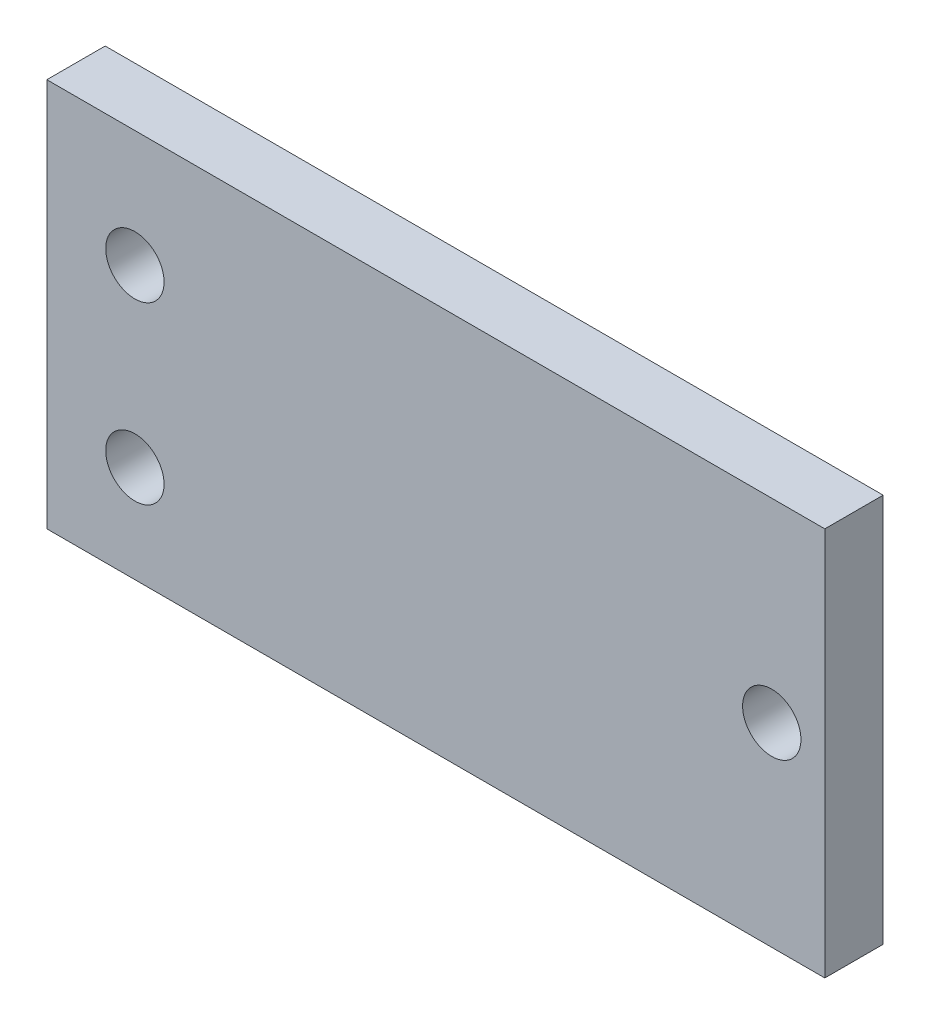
ISO-10303-21;
HEADER;
FILE_DESCRIPTION(('STEP AP214'),'2;1');
FILE_NAME('part.step','',(''),(''),'','','');
FILE_SCHEMA(('AUTOMOTIVE_DESIGN { 1 0 10303 214 1 1 1 1 }'));
ENDSEC;
DATA;
#1=APPLICATION_CONTEXT('core data for automotive mechanical design processes');
#2=APPLICATION_PROTOCOL_DEFINITION('international standard','automotive_design',2000,#1);
#3=PRODUCT_CONTEXT('',#1,'mechanical');
#4=PRODUCT('Part','Part','',(#3));
#5=PRODUCT_RELATED_PRODUCT_CATEGORY('part','',(#4));
#6=PRODUCT_DEFINITION_FORMATION('','',#4);
#7=PRODUCT_DEFINITION_CONTEXT('part definition',#1,'design');
#8=PRODUCT_DEFINITION('design','',#6,#7);
#9=PRODUCT_DEFINITION_SHAPE('','',#8);
#10=(LENGTH_UNIT() NAMED_UNIT(*) SI_UNIT(.MILLI.,.METRE.));
#11=(NAMED_UNIT(*) PLANE_ANGLE_UNIT() SI_UNIT($,.RADIAN.));
#12=(NAMED_UNIT(*) SI_UNIT($,.STERADIAN.) SOLID_ANGLE_UNIT());
#13=UNCERTAINTY_MEASURE_WITH_UNIT(LENGTH_MEASURE(1.E-05),#10,'distance_accuracy_value','');
#14=(GEOMETRIC_REPRESENTATION_CONTEXT(3) GLOBAL_UNCERTAINTY_ASSIGNED_CONTEXT((#13)) GLOBAL_UNIT_ASSIGNED_CONTEXT((#10,
#11,#12)) REPRESENTATION_CONTEXT('',''));
#15=CARTESIAN_POINT('',(0.,0.,0.));
#16=DIRECTION('',(0.,0.,1.));
#17=DIRECTION('',(1.,0.,0.));
#18=AXIS2_PLACEMENT_3D('',#15,#16,#17);
#19=CARTESIAN_POINT('',(0.,0.,3.));
#20=DIRECTION('',(0.,0.,1.));
#21=DIRECTION('',(1.,0.,0.));
#22=AXIS2_PLACEMENT_3D('',#19,#20,#21);
#23=PLANE('',#22);
#24=CARTESIAN_POINT('',(4.52685421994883,-6.,3.));
#25=DIRECTION('',(0.,0.,1.));
#26=DIRECTION('',(1.,0.,0.));
#27=AXIS2_PLACEMENT_3D('',#24,#25,#26);
#28=CIRCLE('',#27,1.5);
#29=CARTESIAN_POINT('',(6.02685421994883,-6.,3.));
#30=VERTEX_POINT('',#29);
#31=EDGE_CURVE('E134',#30,#30,#28,.T.);
#32=ORIENTED_EDGE('',*,*,#31,.F.);
#33=EDGE_LOOP('',(#32));
#34=FACE_BOUND('',#33,.T.);
#35=DIRECTION('',(0.,-1.,0.));
#36=VECTOR('',#35,1.);
#37=CARTESIAN_POINT('',(0.,0.,3.));
#38=LINE('',#37,#36);
#39=CARTESIAN_POINT('',(0.,0.,3.));
#40=VERTEX_POINT('',#39);
#41=CARTESIAN_POINT('',(0.,-20.,3.));
#42=VERTEX_POINT('',#41);
#43=EDGE_CURVE('E92',#40,#42,#38,.T.);
#44=ORIENTED_EDGE('',*,*,#43,.T.);
#45=DIRECTION('',(1.,0.,0.));
#46=VECTOR('',#45,1.);
#47=CARTESIAN_POINT('',(0.,-20.,3.));
#48=LINE('',#47,#46);
#49=CARTESIAN_POINT('',(40.,-20.,3.));
#50=VERTEX_POINT('',#49);
#51=EDGE_CURVE('E87',#42,#50,#48,.T.);
#52=ORIENTED_EDGE('',*,*,#51,.T.);
#53=DIRECTION('',(0.,1.,0.));
#54=VECTOR('',#53,1.);
#55=CARTESIAN_POINT('',(40.,0.,3.));
#56=LINE('',#55,#54);
#57=CARTESIAN_POINT('',(40.,0.,3.));
#58=VERTEX_POINT('',#57);
#59=EDGE_CURVE('E90',#50,#58,#56,.T.);
#60=ORIENTED_EDGE('',*,*,#59,.T.);
#61=DIRECTION('',(-1.,0.,0.));
#62=VECTOR('',#61,1.);
#63=CARTESIAN_POINT('',(0.,0.,3.));
#64=LINE('',#63,#62);
#65=EDGE_CURVE('E57',#58,#40,#64,.T.);
#66=ORIENTED_EDGE('',*,*,#65,.T.);
#67=EDGE_LOOP('',(#44,#52,#60,#66));
#68=FACE_BOUND('',#67,.T.);
#69=CARTESIAN_POINT('',(37.2725058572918,-10.,3.));
#70=DIRECTION('',(0.,0.,1.));
#71=DIRECTION('',(1.,0.,0.));
#72=AXIS2_PLACEMENT_3D('',#69,#70,#71);
#73=CIRCLE('',#72,1.5);
#74=CARTESIAN_POINT('',(38.7725058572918,-10.,3.));
#75=VERTEX_POINT('',#74);
#76=EDGE_CURVE('E112',#75,#75,#73,.T.);
#77=ORIENTED_EDGE('',*,*,#76,.F.);
#78=EDGE_LOOP('',(#77));
#79=FACE_BOUND('',#78,.T.);
#80=CARTESIAN_POINT('',(4.52685421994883,-15.,3.));
#81=DIRECTION('',(0.,0.,1.));
#82=DIRECTION('',(1.,0.,0.));
#83=AXIS2_PLACEMENT_3D('',#80,#81,#82);
#84=CIRCLE('',#83,1.5);
#85=CARTESIAN_POINT('',(6.02685421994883,-15.,3.));
#86=VERTEX_POINT('',#85);
#87=EDGE_CURVE('E142',#86,#86,#84,.T.);
#88=ORIENTED_EDGE('',*,*,#87,.F.);
#89=EDGE_LOOP('',(#88));
#90=FACE_BOUND('',#89,.T.);
#91=ADVANCED_FACE('F39',(#34,#68,#79,#90),#23,.T.);
#92=CARTESIAN_POINT('',(0.,0.,0.));
#93=DIRECTION('',(0.,0.,1.));
#94=DIRECTION('',(1.,0.,0.));
#95=AXIS2_PLACEMENT_3D('',#92,#93,#94);
#96=PLANE('',#95);
#97=DIRECTION('',(0.,-1.,0.));
#98=VECTOR('',#97,1.);
#99=CARTESIAN_POINT('',(0.,0.,0.));
#100=LINE('',#99,#98);
#101=CARTESIAN_POINT('',(0.,0.,0.));
#102=VERTEX_POINT('',#101);
#103=CARTESIAN_POINT('',(0.,-20.,0.));
#104=VERTEX_POINT('',#103);
#105=EDGE_CURVE('E108',#102,#104,#100,.T.);
#106=ORIENTED_EDGE('',*,*,#105,.F.);
#107=DIRECTION('',(-1.,0.,0.));
#108=VECTOR('',#107,1.);
#109=CARTESIAN_POINT('',(0.,0.,0.));
#110=LINE('',#109,#108);
#111=CARTESIAN_POINT('',(40.,0.,0.));
#112=VERTEX_POINT('',#111);
#113=EDGE_CURVE('E80',#112,#102,#110,.T.);
#114=ORIENTED_EDGE('',*,*,#113,.F.);
#115=DIRECTION('',(0.,1.,0.));
#116=VECTOR('',#115,1.);
#117=CARTESIAN_POINT('',(40.,0.,0.));
#118=LINE('',#117,#116);
#119=CARTESIAN_POINT('',(40.,-20.,0.));
#120=VERTEX_POINT('',#119);
#121=EDGE_CURVE('E74',#120,#112,#118,.T.);
#122=ORIENTED_EDGE('',*,*,#121,.F.);
#123=DIRECTION('',(1.,0.,0.));
#124=VECTOR('',#123,1.);
#125=CARTESIAN_POINT('',(0.,-20.,0.));
#126=LINE('',#125,#124);
#127=EDGE_CURVE('E97',#104,#120,#126,.T.);
#128=ORIENTED_EDGE('',*,*,#127,.F.);
#129=EDGE_LOOP('',(#106,#114,#122,#128));
#130=FACE_BOUND('',#129,.T.);
#131=CARTESIAN_POINT('',(37.2725058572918,-10.,0.));
#132=DIRECTION('',(0.,0.,1.));
#133=DIRECTION('',(1.,0.,0.));
#134=AXIS2_PLACEMENT_3D('',#131,#132,#133);
#135=CIRCLE('',#134,1.5);
#136=CARTESIAN_POINT('',(38.7725058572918,-10.,0.));
#137=VERTEX_POINT('',#136);
#138=EDGE_CURVE('E130',#137,#137,#135,.T.);
#139=ORIENTED_EDGE('',*,*,#138,.T.);
#140=EDGE_LOOP('',(#139));
#141=FACE_BOUND('',#140,.T.);
#142=CARTESIAN_POINT('',(4.52685421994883,-6.,0.));
#143=DIRECTION('',(0.,0.,1.));
#144=DIRECTION('',(1.,0.,0.));
#145=AXIS2_PLACEMENT_3D('',#142,#143,#144);
#146=CIRCLE('',#145,1.5);
#147=CARTESIAN_POINT('',(6.02685421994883,-6.,0.));
#148=VERTEX_POINT('',#147);
#149=EDGE_CURVE('E138',#148,#148,#146,.T.);
#150=ORIENTED_EDGE('',*,*,#149,.T.);
#151=EDGE_LOOP('',(#150));
#152=FACE_BOUND('',#151,.T.);
#153=CARTESIAN_POINT('',(4.52685421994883,-15.,0.));
#154=DIRECTION('',(0.,0.,1.));
#155=DIRECTION('',(1.,0.,0.));
#156=AXIS2_PLACEMENT_3D('',#153,#154,#155);
#157=CIRCLE('',#156,1.5);
#158=CARTESIAN_POINT('',(6.02685421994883,-15.,0.));
#159=VERTEX_POINT('',#158);
#160=EDGE_CURVE('E146',#159,#159,#157,.T.);
#161=ORIENTED_EDGE('',*,*,#160,.T.);
#162=EDGE_LOOP('',(#161));
#163=FACE_BOUND('',#162,.T.);
#164=ADVANCED_FACE('F125',(#130,#141,#152,#163),#96,.F.);
#165=CARTESIAN_POINT('',(0.,0.,3.));
#166=DIRECTION('',(1.,0.,0.));
#167=DIRECTION('',(0.,1.,0.));
#168=AXIS2_PLACEMENT_3D('',#165,#166,#167);
#169=PLANE('',#168);
#170=ORIENTED_EDGE('',*,*,#105,.T.);
#171=DIRECTION('',(0.,0.,-1.));
#172=VECTOR('',#171,1.);
#173=CARTESIAN_POINT('',(0.,-20.,3.));
#174=LINE('',#173,#172);
#175=EDGE_CURVE('E11',#42,#104,#174,.T.);
#176=ORIENTED_EDGE('',*,*,#175,.F.);
#177=ORIENTED_EDGE('',*,*,#43,.F.);
#178=DIRECTION('',(0.,0.,-1.));
#179=VECTOR('',#178,1.);
#180=CARTESIAN_POINT('',(0.,0.,3.));
#181=LINE('',#180,#179);
#182=EDGE_CURVE('E104',#40,#102,#181,.T.);
#183=ORIENTED_EDGE('',*,*,#182,.T.);
#184=EDGE_LOOP('',(#170,#176,#177,#183));
#185=FACE_BOUND('',#184,.T.);
#186=ADVANCED_FACE('F41',(#185),#169,.F.);
#187=CARTESIAN_POINT('',(0.,-20.,3.));
#188=DIRECTION('',(0.,1.,0.));
#189=DIRECTION('',(0.,0.,1.));
#190=AXIS2_PLACEMENT_3D('',#187,#188,#189);
#191=PLANE('',#190);
#192=ORIENTED_EDGE('',*,*,#127,.T.);
#193=DIRECTION('',(0.,0.,-1.));
#194=VECTOR('',#193,1.);
#195=CARTESIAN_POINT('',(40.,-20.,3.));
#196=LINE('',#195,#194);
#197=EDGE_CURVE('E49',#50,#120,#196,.T.);
#198=ORIENTED_EDGE('',*,*,#197,.F.);
#199=ORIENTED_EDGE('',*,*,#51,.F.);
#200=ORIENTED_EDGE('',*,*,#175,.T.);
#201=EDGE_LOOP('',(#192,#198,#199,#200));
#202=FACE_BOUND('',#201,.T.);
#203=ADVANCED_FACE('F96',(#202),#191,.F.);
#204=CARTESIAN_POINT('',(40.,0.,3.));
#205=DIRECTION('',(-1.,0.,0.));
#206=DIRECTION('',(0.,-1.,0.));
#207=AXIS2_PLACEMENT_3D('',#204,#205,#206);
#208=PLANE('',#207);
#209=ORIENTED_EDGE('',*,*,#121,.T.);
#210=DIRECTION('',(0.,0.,-1.));
#211=VECTOR('',#210,1.);
#212=CARTESIAN_POINT('',(40.,0.,3.));
#213=LINE('',#212,#211);
#214=EDGE_CURVE('E99',#58,#112,#213,.T.);
#215=ORIENTED_EDGE('',*,*,#214,.F.);
#216=ORIENTED_EDGE('',*,*,#59,.F.);
#217=ORIENTED_EDGE('',*,*,#197,.T.);
#218=EDGE_LOOP('',(#209,#215,#216,#217));
#219=FACE_BOUND('',#218,.T.);
#220=ADVANCED_FACE('F100',(#219),#208,.F.);
#221=CARTESIAN_POINT('',(0.,0.,3.));
#222=DIRECTION('',(0.,-1.,0.));
#223=DIRECTION('',(0.,0.,-1.));
#224=AXIS2_PLACEMENT_3D('',#221,#222,#223);
#225=PLANE('',#224);
#226=ORIENTED_EDGE('',*,*,#113,.T.);
#227=ORIENTED_EDGE('',*,*,#182,.F.);
#228=ORIENTED_EDGE('',*,*,#65,.F.);
#229=ORIENTED_EDGE('',*,*,#214,.T.);
#230=EDGE_LOOP('',(#226,#227,#228,#229));
#231=FACE_BOUND('',#230,.T.);
#232=ADVANCED_FACE('F122',(#231),#225,.F.);
#233=CARTESIAN_POINT('',(37.2725058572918,-10.,3.));
#234=DIRECTION('',(0.,0.,-1.));
#235=DIRECTION('',(-1.,0.,0.));
#236=AXIS2_PLACEMENT_3D('',#233,#234,#235);
#237=CYLINDRICAL_SURFACE('',#236,1.5);
#238=ORIENTED_EDGE('',*,*,#76,.T.);
#239=EDGE_LOOP('',(#238));
#240=FACE_BOUND('',#239,.T.);
#241=ORIENTED_EDGE('',*,*,#138,.F.);
#242=EDGE_LOOP('',(#241));
#243=FACE_BOUND('',#242,.T.);
#244=ADVANCED_FACE('F166',(#240,#243),#237,.F.);
#245=CARTESIAN_POINT('',(4.52685421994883,-6.,3.));
#246=DIRECTION('',(0.,0.,-1.));
#247=DIRECTION('',(-1.,0.,0.));
#248=AXIS2_PLACEMENT_3D('',#245,#246,#247);
#249=CYLINDRICAL_SURFACE('',#248,1.5);
#250=ORIENTED_EDGE('',*,*,#31,.T.);
#251=EDGE_LOOP('',(#250));
#252=FACE_BOUND('',#251,.T.);
#253=ORIENTED_EDGE('',*,*,#149,.F.);
#254=EDGE_LOOP('',(#253));
#255=FACE_BOUND('',#254,.T.);
#256=ADVANCED_FACE('F212',(#252,#255),#249,.F.);
#257=CARTESIAN_POINT('',(4.52685421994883,-15.,3.));
#258=DIRECTION('',(0.,0.,-1.));
#259=DIRECTION('',(-1.,0.,0.));
#260=AXIS2_PLACEMENT_3D('',#257,#258,#259);
#261=CYLINDRICAL_SURFACE('',#260,1.5);
#262=ORIENTED_EDGE('',*,*,#87,.T.);
#263=EDGE_LOOP('',(#262));
#264=FACE_BOUND('',#263,.T.);
#265=ORIENTED_EDGE('',*,*,#160,.F.);
#266=EDGE_LOOP('',(#265));
#267=FACE_BOUND('',#266,.T.);
#268=ADVANCED_FACE('F154',(#264,#267),#261,.F.);
#269=CLOSED_SHELL('',(#91,#164,#186,#203,#220,#232,#244,#256,#268));
#270=MANIFOLD_SOLID_BREP('B2',#269);
#271=ADVANCED_BREP_SHAPE_REPRESENTATION('',(#18,#270),#14);
#272=SHAPE_DEFINITION_REPRESENTATION(#9,#271);
ENDSEC;
END-ISO-10303-21;
